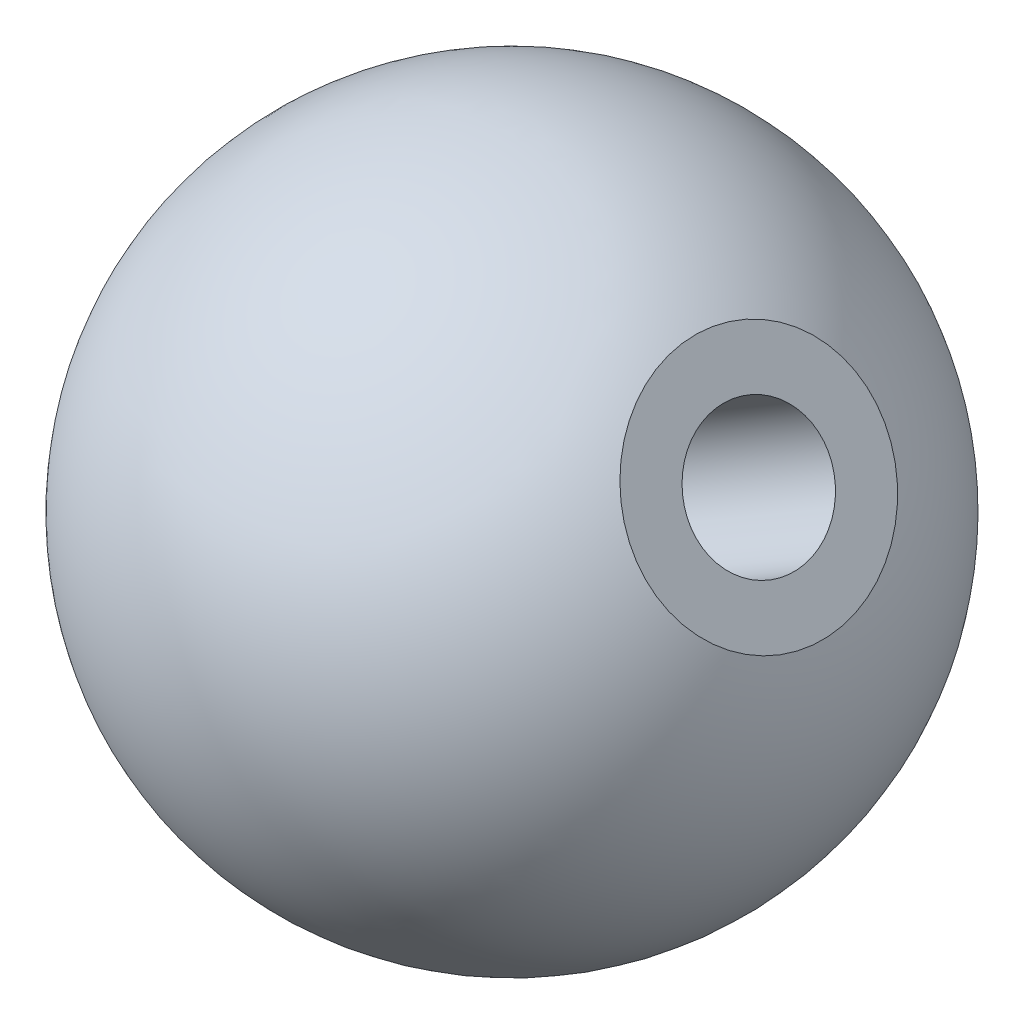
from build123d import *

# Parameters (mm, degrees)
M5_TAPPED_HOLE1_D     = 4.2
M5_TAPPED_HOLE1_DEPTH = 12.4
M5_TAPPED_HOLE1_TIP   = 1.2618073
SKETCH3_R             = 4.055
CUT_EXTRUDE1_DEPTH    = 0.5


with BuildPart() as part:
    # Sketch1 → Revolve1 (revolve)
    with BuildSketch(Plane.XY):
        with BuildLine():
            Line((0, -10.5), (0, 10.5))
            ThreePointArc((0, 10.5), (-10.5, 0), (0, -10.5))
        make_face()
    revolve(axis=Axis((0, -10.5, 0), (0, 1, 0)))

    # M5 Tapped Hole1
    with Locations(Plane(origin=(8.952472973, 5.462186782, 0.517439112), x_dir=(-0.520841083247, 0.853653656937, 0), z_dir=(0.852616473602, 0.520208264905, 0.049279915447))):
        with Locations((0, 0)):
            Hole(M5_TAPPED_HOLE1_D / 2, depth=M5_TAPPED_HOLE1_DEPTH)
            with Locations((0, 0, -(M5_TAPPED_HOLE1_DEPTH + M5_TAPPED_HOLE1_TIP / 2))):  # 118° drill point
                Cone(0, M5_TAPPED_HOLE1_D / 2, M5_TAPPED_HOLE1_TIP, mode=Mode.SUBTRACT)

    # Sketch3 → Cut-Extrude1 (cut)
    with BuildSketch(Plane(origin=(8.771596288, 5.351828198, 0.506984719), x_dir=(0.04206798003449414, 0.025667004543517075, -0.9987850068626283), z_dir=(0.85261647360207, 0.5202082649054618, 0.04927991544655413))):
        Circle(SKETCH3_R)
    extrude(amount=-CUT_EXTRUDE1_DEPTH, mode=Mode.SUBTRACT)


solid = part.part
